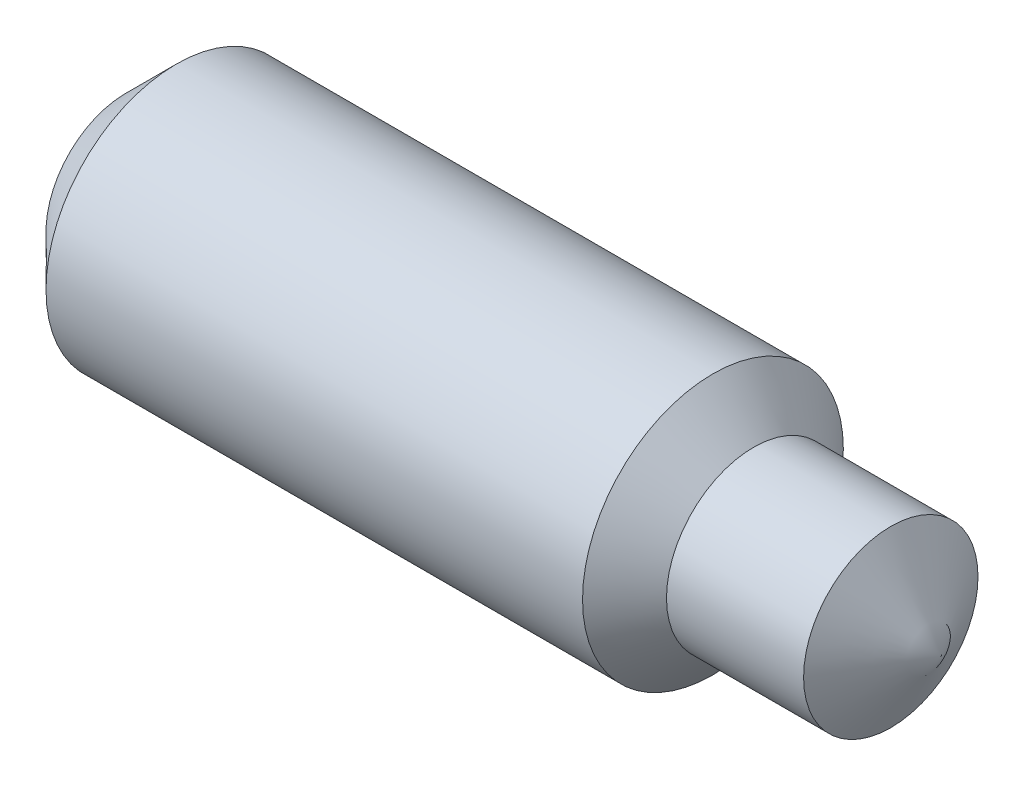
from build123d import *

# Parameters (mm, degrees)
HEADCHAMFER_SIZE = 1.5415


with BuildPart() as part:
    # Sketch1 → Base (revolve)
    with BuildSketch(Plane.XY, mode=Mode.PRIVATE) as base_sk:
        Polygon((0, 0), (0, 4), (18, 4), (19.25, 2.675), (25, 2.675), (25, 0), align=None)
    revolve(base_sk.sketch.rotate(Axis((-1.328405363, 0, 0), (1, 0, 0)), 90), axis=Axis((-1.328405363, 0, 0), (1, 0, 0)))

    # HeadChamfer
    headchamfer_edges = [part.edges().sort_by_distance(p)[0] for p in [
        (0, 0, -4),
    ]]
    chamfer(headchamfer_edges, length=HEADCHAMFER_SIZE)

    # Sketch2 → Cut-Extrude3 (revolve, cut)
    with BuildSketch(Plane(origin=(0, 0, 0), x_dir=(1, 0, 0), z_dir=(0, 1, 0)), mode=Mode.PRIVATE) as cut_extrude3_sk:
        Polygon((25, 0), (23.45558803, 2.675), (23.45558803, 5), (27, 5), (27, 0), align=None)
    revolve(cut_extrude3_sk.sketch.rotate(Axis((27.052722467, 0, 0), (-1, 0, 0)), 180), axis=Axis((27.052722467, 0, 0), (-1, 0, 0)), mode=Mode.SUBTRACT)


solid = part.part
